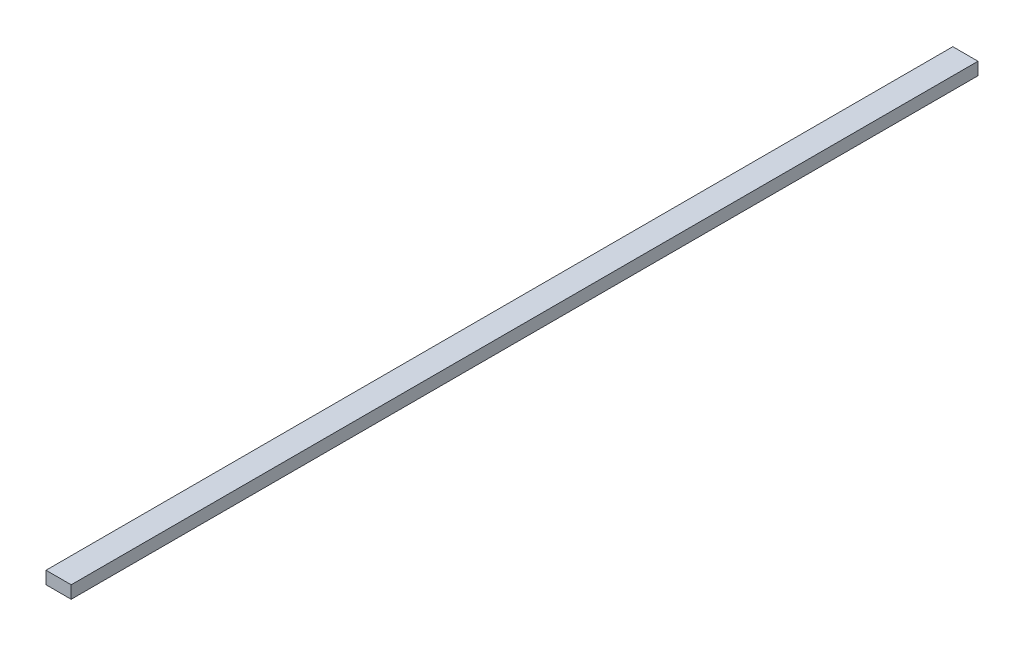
from build123d import *

# Parameters (mm, degrees)
SKETCH1_W           = 101.6
SKETCH1_H           = 3657.6
BOSS_EXTRUDE1_DEPTH = 50.8


with BuildPart() as part:
    # Sketch1 → Boss-Extrude1 (new body)
    with BuildSketch(Plane(origin=(0, 0, 0), x_dir=(1, 0, 0), z_dir=(0, 1, 0))):
        with Locations((-50.8, -1828.8)):
            Rectangle(SKETCH1_W, SKETCH1_H)
    extrude(amount=BOSS_EXTRUDE1_DEPTH)


solid = part.part
